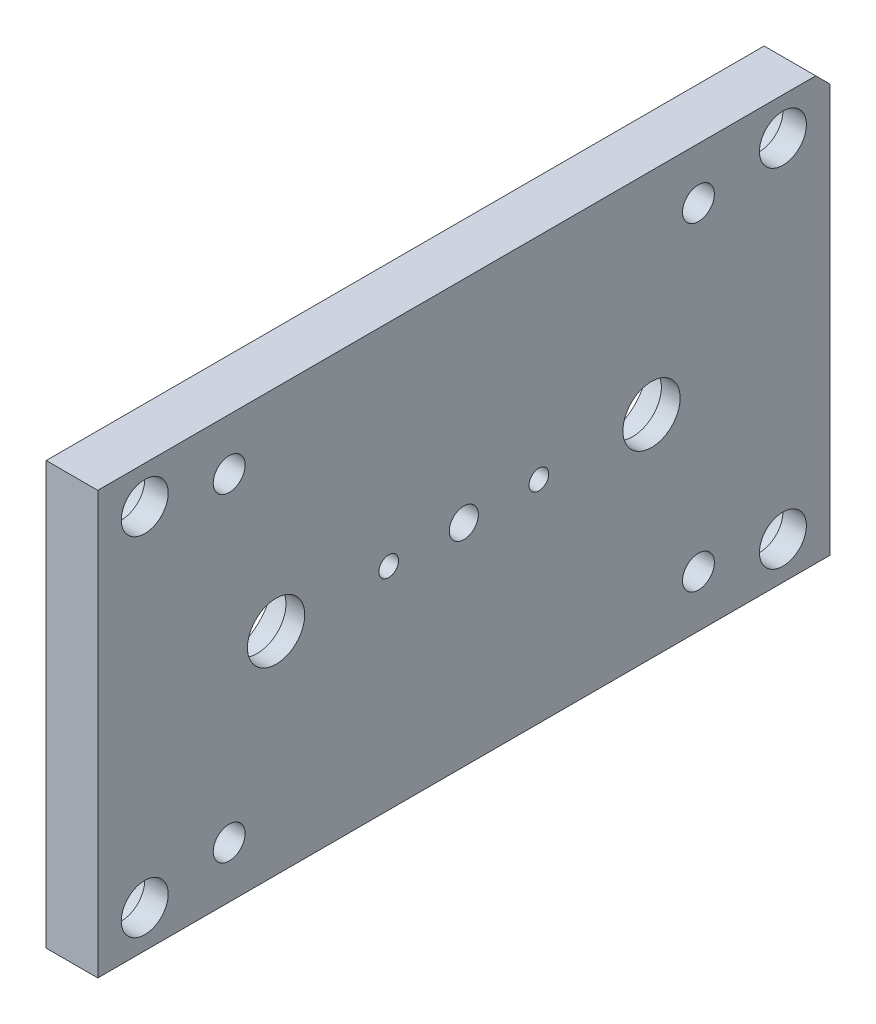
from build123d import *

# Parameters (mm, degrees)
ESQUISSE1_W             = 156
ESQUISSE1_H             = 90
EXTRUSION1_DEPTH        = 11
ESQUISSE32_R            = 6.1
ESQUISSE32_R_2          = 5
ESQUISSE32_R_3          = 3.1
ESQUISSE32_R_4          = 2.1
ENL_V_MAT_EXTRU_1_DEPTH = 133.540790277
TROU_TARAUD_M81_D       = 6.8
ESQUISSE35_R            = 7.5
ENL_V_MAT_EXTRU_2_DEPTH = 6
ESQUISSE37_R            = 4.25
ENL_V_MAT_EXTRU_4_DEPTH = 4
ESQUISSE38_R            = 10.5
ENL_V_MAT_EXTRU_5_DEPTH = 7
CHANFREIN_D_SIZE        = 3


with BuildPart() as part:
    # Esquisse1 → Extrusion1 (new body)
    with BuildSketch(Plane(origin=(0, 0, 0), x_dir=(0, 0, -1), z_dir=(1, 0, 0))):
        Rectangle(ESQUISSE1_W, ESQUISSE1_H)
    extrude(amount=EXTRUSION1_DEPTH)

    # Esquisse32 → Enl_v. mat.-Extru.1 (cut, through all)
    with BuildSketch(Plane(origin=(0, 29.694794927, -30.93460744), x_dir=(0, 0, 1), z_dir=(-1, 0, 0))):
        with Locations((-9.06539256, -29.694794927)):
            Circle(ESQUISSE32_R)
        with Locations((-37.06539256, 7.305205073)):
            Circle(ESQUISSE32_R_2)
        with Locations((70.93460744, -29.694794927)):
            Circle(ESQUISSE32_R)
        with Locations((98.93460744, 7.305205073)):
            Circle(ESQUISSE32_R_2)
        with Locations((98.93460744, -66.694794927)):
            Circle(ESQUISSE32_R_2)
        with Locations((-37.06539256, -66.694794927)):
            Circle(ESQUISSE32_R_2)
        with Locations((30.93460744, -29.694794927)):
            Circle(ESQUISSE32_R_3)
        with Locations((14.93460744, -29.694794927)):
            Circle(ESQUISSE32_R_4)
        with Locations((46.93460744, -29.694794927)):
            Circle(ESQUISSE32_R_4)
    extrude(amount=-ENL_V_MAT_EXTRU_1_DEPTH, mode=Mode.SUBTRACT)

    # Trou taraud_ M81 (through all)
    with Locations(Plane.ZY):
        with Locations((50, 34), (-50, 34), (-50, -34), (50, -34)):
            Hole(TROU_TARAUD_M81_D / 2)

    # Esquisse35 → Enl_v. mat.-Extru.2 (cut)
    with BuildSketch(Plane.ZY):
        with Locations((-68, 37)):
            Circle(ESQUISSE35_R)
        with Locations((68, 37)):
            Circle(ESQUISSE35_R)
        with Locations((68, -37)):
            Circle(ESQUISSE35_R)
        with Locations((-68, -37)):
            Circle(ESQUISSE35_R)
    extrude(amount=-ENL_V_MAT_EXTRU_2_DEPTH, mode=Mode.SUBTRACT)

    # Esquisse37 → Enl_v. mat.-Extru.4 (cut)
    with BuildSketch(Plane.ZY):
        with Locations((-16, 0)):
            Circle(ESQUISSE37_R)
        with Locations((16, 0)):
            Circle(ESQUISSE37_R)
    extrude(amount=-ENL_V_MAT_EXTRU_4_DEPTH, mode=Mode.SUBTRACT)

    # Esquisse38 → Enl_v. mat.-Extru.5 (cut)
    with BuildSketch(Plane.ZY):
        with Locations((-40, 0)):
            Circle(ESQUISSE38_R)
        with Locations((40, 0)):
            Circle(ESQUISSE38_R)
    extrude(amount=-ENL_V_MAT_EXTRU_5_DEPTH, mode=Mode.SUBTRACT)

    # Chanfrein_D
    chanfrein_d_edges = [part.edges().sort_by_distance(p)[0] for p in [
        (5.5, 45, -78),
    ]]
    chamfer(chanfrein_d_edges, length=CHANFREIN_D_SIZE)


solid = part.part
